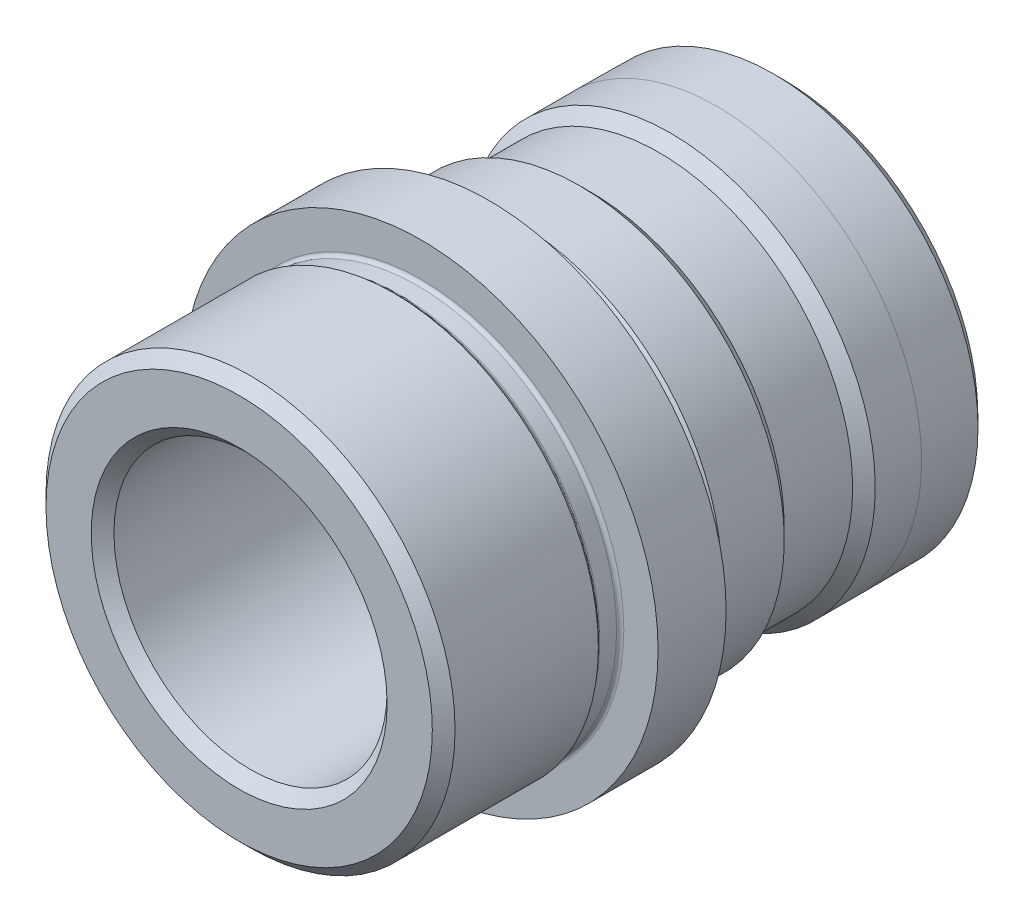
ISO-10303-21;
HEADER;
FILE_DESCRIPTION(('STEP AP214'),'2;1');
FILE_NAME('part.step','',(''),(''),'','','');
FILE_SCHEMA(('AUTOMOTIVE_DESIGN { 1 0 10303 214 1 1 1 1 }'));
ENDSEC;
DATA;
#1=APPLICATION_CONTEXT('core data for automotive mechanical design processes');
#2=APPLICATION_PROTOCOL_DEFINITION('international standard','automotive_design',2000,#1);
#3=PRODUCT_CONTEXT('',#1,'mechanical');
#4=PRODUCT('Part','Part','',(#3));
#5=PRODUCT_RELATED_PRODUCT_CATEGORY('part','',(#4));
#6=PRODUCT_DEFINITION_FORMATION('','',#4);
#7=PRODUCT_DEFINITION_CONTEXT('part definition',#1,'design');
#8=PRODUCT_DEFINITION('design','',#6,#7);
#9=PRODUCT_DEFINITION_SHAPE('','',#8);
#10=(LENGTH_UNIT() NAMED_UNIT(*) SI_UNIT(.MILLI.,.METRE.));
#11=(NAMED_UNIT(*) PLANE_ANGLE_UNIT() SI_UNIT($,.RADIAN.));
#12=(NAMED_UNIT(*) SI_UNIT($,.STERADIAN.) SOLID_ANGLE_UNIT());
#13=UNCERTAINTY_MEASURE_WITH_UNIT(LENGTH_MEASURE(1.E-05),#10,'distance_accuracy_value','');
#14=(GEOMETRIC_REPRESENTATION_CONTEXT(3) GLOBAL_UNCERTAINTY_ASSIGNED_CONTEXT((#13)) GLOBAL_UNIT_ASSIGNED_CONTEXT((#10,
#11,#12)) REPRESENTATION_CONTEXT('',''));
#15=CARTESIAN_POINT('',(0.,0.,0.));
#16=DIRECTION('',(0.,0.,1.));
#17=DIRECTION('',(1.,0.,0.));
#18=AXIS2_PLACEMENT_3D('',#15,#16,#17);
#19=CARTESIAN_POINT('',(0.,9.53262,12.7));
#20=DIRECTION('',(0.,0.,1.));
#21=DIRECTION('',(1.,0.,0.));
#22=AXIS2_PLACEMENT_3D('',#19,#20,#21);
#23=PLANE('',#22);
#24=CARTESIAN_POINT('',(0.,0.,12.7));
#25=DIRECTION('',(0.,0.,1.));
#26=DIRECTION('',(1.,0.,0.));
#27=AXIS2_PLACEMENT_3D('',#24,#25,#26);
#28=CIRCLE('',#27,13.48105);
#29=CARTESIAN_POINT('',(13.48105,0.,12.7));
#30=VERTEX_POINT('',#29);
#31=EDGE_CURVE('E65',#30,#30,#28,.T.);
#32=ORIENTED_EDGE('',*,*,#31,.T.);
#33=EDGE_LOOP('',(#32));
#34=FACE_BOUND('',#33,.T.);
#35=CARTESIAN_POINT('',(0.,0.,12.7));
#36=DIRECTION('',(0.,0.,1.));
#37=DIRECTION('',(1.,0.,0.));
#38=AXIS2_PLACEMENT_3D('',#35,#36,#37);
#39=CIRCLE('',#38,10.32637);
#40=CARTESIAN_POINT('',(10.32637,0.,12.7));
#41=VERTEX_POINT('',#40);
#42=EDGE_CURVE('E68',#41,#41,#39,.F.);
#43=ORIENTED_EDGE('',*,*,#42,.T.);
#44=EDGE_LOOP('',(#43));
#45=FACE_BOUND('',#44,.T.);
#46=ADVANCED_FACE('F30',(#34,#45),#23,.T.);
#47=CARTESIAN_POINT('',(0.,0.,0.));
#48=DIRECTION('',(0.,0.,-1.));
#49=DIRECTION('',(-1.,0.,0.));
#50=AXIS2_PLACEMENT_3D('',#47,#48,#49);
#51=CYLINDRICAL_SURFACE('',#50,14.2748);
#52=CARTESIAN_POINT('',(0.,0.,11.90625));
#53=DIRECTION('',(0.,0.,1.));
#54=DIRECTION('',(1.,0.,0.));
#55=AXIS2_PLACEMENT_3D('',#52,#53,#54);
#56=CIRCLE('',#55,14.2748);
#57=CARTESIAN_POINT('',(14.2748,0.,11.90625));
#58=VERTEX_POINT('',#57);
#59=EDGE_CURVE('E71',#58,#58,#56,.F.);
#60=ORIENTED_EDGE('',*,*,#59,.T.);
#61=EDGE_LOOP('',(#60));
#62=FACE_BOUND('',#61,.T.);
#63=CARTESIAN_POINT('',(0.,0.,1.905));
#64=DIRECTION('',(0.,0.,-1.));
#65=DIRECTION('',(-1.,0.,0.));
#66=AXIS2_PLACEMENT_3D('',#63,#64,#65);
#67=CIRCLE('',#66,14.2748);
#68=CARTESIAN_POINT('',(-14.2748,0.,1.905));
#69=VERTEX_POINT('',#68);
#70=EDGE_CURVE('E86',#69,#69,#67,.T.);
#71=ORIENTED_EDGE('',*,*,#70,.F.);
#72=EDGE_LOOP('',(#71));
#73=FACE_BOUND('',#72,.T.);
#74=ADVANCED_FACE('F155',(#62,#73),#51,.T.);
#75=CARTESIAN_POINT('',(0.,0.,1.524));
#76=DIRECTION('',(0.,0.,1.));
#77=DIRECTION('',(1.,0.,0.));
#78=AXIS2_PLACEMENT_3D('',#75,#76,#77);
#79=CONICAL_SURFACE('',#78,13.8938,0.785398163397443);
#80=CARTESIAN_POINT('',(0.,0.,1.59839487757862));
#81=DIRECTION('',(0.,0.,1.));
#82=DIRECTION('',(1.,0.,0.));
#83=AXIS2_PLACEMENT_3D('',#80,#81,#82);
#84=CIRCLE('',#83,13.9681948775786);
#85=CARTESIAN_POINT('',(13.9681948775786,0.,1.59839487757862));
#86=VERTEX_POINT('',#85);
#87=EDGE_CURVE('E37',#86,#86,#84,.T.);
#88=ORIENTED_EDGE('',*,*,#87,.T.);
#89=EDGE_LOOP('',(#88));
#90=FACE_BOUND('',#89,.T.);
#91=ORIENTED_EDGE('',*,*,#70,.T.);
#92=EDGE_LOOP('',(#91));
#93=FACE_BOUND('',#92,.T.);
#94=ADVANCED_FACE('F151',(#90,#93),#79,.T.);
#95=CARTESIAN_POINT('',(0.,0.,0.));
#96=DIRECTION('',(0.,0.,-1.));
#97=DIRECTION('',(-1.,0.,0.));
#98=AXIS2_PLACEMENT_3D('',#95,#96,#97);
#99=CYLINDRICAL_SURFACE('',#98,13.8938);
#100=CARTESIAN_POINT('',(0.,0.,1.41878975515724));
#101=DIRECTION('',(0.,0.,-1.));
#102=DIRECTION('',(-1.,0.,0.));
#103=AXIS2_PLACEMENT_3D('',#100,#101,#102);
#104=CIRCLE('',#103,13.8938);
#105=CARTESIAN_POINT('',(-13.8938,0.,1.41878975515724));
#106=VERTEX_POINT('',#105);
#107=EDGE_CURVE('E41',#106,#106,#104,.T.);
#108=ORIENTED_EDGE('',*,*,#107,.T.);
#109=EDGE_LOOP('',(#108));
#110=FACE_BOUND('',#109,.T.);
#111=CARTESIAN_POINT('',(0.,0.,0.254));
#112=DIRECTION('',(0.,0.,1.));
#113=DIRECTION('',(1.,0.,0.));
#114=AXIS2_PLACEMENT_3D('',#111,#112,#113);
#115=CIRCLE('',#114,13.8938);
#116=CARTESIAN_POINT('',(13.8938,0.,0.254));
#117=VERTEX_POINT('',#116);
#118=EDGE_CURVE('E45',#117,#117,#115,.T.);
#119=ORIENTED_EDGE('',*,*,#118,.T.);
#120=EDGE_LOOP('',(#119));
#121=FACE_BOUND('',#120,.T.);
#122=ADVANCED_FACE('F148',(#110,#121),#99,.T.);
#123=CARTESIAN_POINT('',(0.,16.5354,0.));
#124=DIRECTION('',(0.,0.,1.));
#125=DIRECTION('',(1.,0.,0.));
#126=AXIS2_PLACEMENT_3D('',#123,#124,#125);
#127=PLANE('',#126);
#128=CARTESIAN_POINT('',(0.,0.,0.));
#129=DIRECTION('',(0.,0.,1.));
#130=DIRECTION('',(1.,0.,0.));
#131=AXIS2_PLACEMENT_3D('',#128,#129,#130);
#132=CIRCLE('',#131,14.1478);
#133=CARTESIAN_POINT('',(14.1478,0.,0.));
#134=VERTEX_POINT('',#133);
#135=EDGE_CURVE('E10',#134,#134,#132,.F.);
#136=ORIENTED_EDGE('',*,*,#135,.T.);
#137=EDGE_LOOP('',(#136));
#138=FACE_BOUND('',#137,.T.);
#139=CARTESIAN_POINT('',(0.,0.,0.));
#140=DIRECTION('',(0.,0.,-1.));
#141=DIRECTION('',(-1.,0.,0.));
#142=AXIS2_PLACEMENT_3D('',#139,#140,#141);
#143=CIRCLE('',#142,16.5354);
#144=CARTESIAN_POINT('',(-16.5354,0.,0.));
#145=VERTEX_POINT('',#144);
#146=EDGE_CURVE('E385',#145,#145,#143,.T.);
#147=ORIENTED_EDGE('',*,*,#146,.F.);
#148=EDGE_LOOP('',(#147));
#149=FACE_BOUND('',#148,.T.);
#150=ADVANCED_FACE('F144',(#138,#149),#127,.T.);
#151=CARTESIAN_POINT('',(0.,0.,0.));
#152=DIRECTION('',(0.,0.,-1.));
#153=DIRECTION('',(-1.,0.,0.));
#154=AXIS2_PLACEMENT_3D('',#151,#152,#153);
#155=CYLINDRICAL_SURFACE('',#154,16.5354);
#156=ORIENTED_EDGE('',*,*,#146,.T.);
#157=EDGE_LOOP('',(#156));
#158=FACE_BOUND('',#157,.T.);
#159=CARTESIAN_POINT('',(0.,0.,-4.7498));
#160=DIRECTION('',(0.,0.,-1.));
#161=DIRECTION('',(-1.,0.,0.));
#162=AXIS2_PLACEMENT_3D('',#159,#160,#161);
#163=CIRCLE('',#162,16.5354);
#164=CARTESIAN_POINT('',(-16.5354,0.,-4.7498));
#165=VERTEX_POINT('',#164);
#166=EDGE_CURVE('E383',#165,#165,#163,.T.);
#167=ORIENTED_EDGE('',*,*,#166,.F.);
#168=EDGE_LOOP('',(#167));
#169=FACE_BOUND('',#168,.T.);
#170=ADVANCED_FACE('F140',(#158,#169),#155,.T.);
#171=CARTESIAN_POINT('',(0.,16.5354,-4.7498));
#172=DIRECTION('',(0.,0.,-1.));
#173=DIRECTION('',(-1.,0.,0.));
#174=AXIS2_PLACEMENT_3D('',#171,#172,#173);
#175=PLANE('',#174);
#176=CARTESIAN_POINT('',(0.,0.,-4.7498));
#177=DIRECTION('',(0.,0.,-1.));
#178=DIRECTION('',(-1.,0.,0.));
#179=AXIS2_PLACEMENT_3D('',#176,#177,#178);
#180=CIRCLE('',#179,14.1478);
#181=CARTESIAN_POINT('',(-14.1478,0.,-4.7498));
#182=VERTEX_POINT('',#181);
#183=EDGE_CURVE('E50',#182,#182,#180,.F.);
#184=ORIENTED_EDGE('',*,*,#183,.T.);
#185=EDGE_LOOP('',(#184));
#186=FACE_BOUND('',#185,.T.);
#187=ORIENTED_EDGE('',*,*,#166,.T.);
#188=EDGE_LOOP('',(#187));
#189=FACE_BOUND('',#188,.T.);
#190=ADVANCED_FACE('F136',(#186,#189),#175,.T.);
#191=CARTESIAN_POINT('',(0.,0.,0.));
#192=DIRECTION('',(0.,0.,-1.));
#193=DIRECTION('',(-1.,0.,0.));
#194=AXIS2_PLACEMENT_3D('',#191,#192,#193);
#195=CYLINDRICAL_SURFACE('',#194,13.8938);
#196=CARTESIAN_POINT('',(0.,0.,-6.16858975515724));
#197=DIRECTION('',(0.,0.,-1.));
#198=DIRECTION('',(-1.,0.,0.));
#199=AXIS2_PLACEMENT_3D('',#196,#197,#198);
#200=CIRCLE('',#199,13.8938);
#201=CARTESIAN_POINT('',(-13.8938,0.,-6.16858975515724));
#202=VERTEX_POINT('',#201);
#203=EDGE_CURVE('E53',#202,#202,#200,.F.);
#204=ORIENTED_EDGE('',*,*,#203,.T.);
#205=EDGE_LOOP('',(#204));
#206=FACE_BOUND('',#205,.T.);
#207=CARTESIAN_POINT('',(0.,0.,-5.0038));
#208=DIRECTION('',(0.,0.,-1.));
#209=DIRECTION('',(-1.,0.,0.));
#210=AXIS2_PLACEMENT_3D('',#207,#208,#209);
#211=CIRCLE('',#210,13.8938);
#212=CARTESIAN_POINT('',(-13.8938,0.,-5.0038));
#213=VERTEX_POINT('',#212);
#214=EDGE_CURVE('E56',#213,#213,#211,.T.);
#215=ORIENTED_EDGE('',*,*,#214,.T.);
#216=EDGE_LOOP('',(#215));
#217=FACE_BOUND('',#216,.T.);
#218=ADVANCED_FACE('F132',(#206,#217),#195,.T.);
#219=CARTESIAN_POINT('',(0.,0.,-6.67385));
#220=DIRECTION('',(0.,0.,-1.));
#221=DIRECTION('',(-1.,0.,0.));
#222=AXIS2_PLACEMENT_3D('',#219,#220,#221);
#223=CONICAL_SURFACE('',#222,14.29385,0.78539816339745);
#224=CARTESIAN_POINT('',(0.,0.,-6.34819487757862));
#225=DIRECTION('',(0.,0.,-1.));
#226=DIRECTION('',(-1.,0.,0.));
#227=AXIS2_PLACEMENT_3D('',#224,#225,#226);
#228=CIRCLE('',#227,13.9681948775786);
#229=CARTESIAN_POINT('',(-13.9681948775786,0.,-6.34819487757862));
#230=VERTEX_POINT('',#229);
#231=EDGE_CURVE('E59',#230,#230,#228,.T.);
#232=ORIENTED_EDGE('',*,*,#231,.T.);
#233=EDGE_LOOP('',(#232));
#234=FACE_BOUND('',#233,.T.);
#235=CARTESIAN_POINT('',(0.,0.,-6.67385));
#236=DIRECTION('',(0.,0.,-1.));
#237=DIRECTION('',(-1.,0.,0.));
#238=AXIS2_PLACEMENT_3D('',#235,#236,#237);
#239=CIRCLE('',#238,14.29385);
#240=CARTESIAN_POINT('',(-14.29385,0.,-6.67385));
#241=VERTEX_POINT('',#240);
#242=EDGE_CURVE('E380',#241,#241,#239,.T.);
#243=ORIENTED_EDGE('',*,*,#242,.F.);
#244=EDGE_LOOP('',(#243));
#245=FACE_BOUND('',#244,.T.);
#246=ADVANCED_FACE('F128',(#234,#245),#223,.T.);
#247=CARTESIAN_POINT('',(0.,0.,0.));
#248=DIRECTION('',(0.,0.,-1.));
#249=DIRECTION('',(-1.,0.,0.));
#250=AXIS2_PLACEMENT_3D('',#247,#248,#249);
#251=CYLINDRICAL_SURFACE('',#250,14.29385);
#252=ORIENTED_EDGE('',*,*,#242,.T.);
#253=EDGE_LOOP('',(#252));
#254=FACE_BOUND('',#253,.T.);
#255=CARTESIAN_POINT('',(0.,0.,-11.049));
#256=DIRECTION('',(0.,0.,-1.));
#257=DIRECTION('',(-1.,0.,0.));
#258=AXIS2_PLACEMENT_3D('',#255,#256,#257);
#259=CIRCLE('',#258,14.29385);
#260=CARTESIAN_POINT('',(-14.29385,0.,-11.049));
#261=VERTEX_POINT('',#260);
#262=EDGE_CURVE('E377',#261,#261,#259,.T.);
#263=ORIENTED_EDGE('',*,*,#262,.F.);
#264=EDGE_LOOP('',(#263));
#265=FACE_BOUND('',#264,.T.);
#266=ADVANCED_FACE('F124',(#254,#265),#251,.T.);
#267=CARTESIAN_POINT('',(0.,0.,-11.8364));
#268=DIRECTION('',(0.,0.,1.));
#269=DIRECTION('',(1.,0.,0.));
#270=AXIS2_PLACEMENT_3D('',#267,#268,#269);
#271=CONICAL_SURFACE('',#270,13.50645,0.785398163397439);
#272=ORIENTED_EDGE('',*,*,#262,.T.);
#273=EDGE_LOOP('',(#272));
#274=FACE_BOUND('',#273,.T.);
#275=CARTESIAN_POINT('',(0.,0.,-11.8364));
#276=DIRECTION('',(0.,0.,-1.));
#277=DIRECTION('',(-1.,0.,0.));
#278=AXIS2_PLACEMENT_3D('',#275,#276,#277);
#279=CIRCLE('',#278,13.50645);
#280=CARTESIAN_POINT('',(-13.50645,0.,-11.8364));
#281=VERTEX_POINT('',#280);
#282=EDGE_CURVE('E371',#281,#281,#279,.T.);
#283=ORIENTED_EDGE('',*,*,#282,.F.);
#284=EDGE_LOOP('',(#283));
#285=FACE_BOUND('',#284,.T.);
#286=ADVANCED_FACE('F119',(#274,#285),#271,.T.);
#287=CARTESIAN_POINT('',(0.,0.,0.));
#288=DIRECTION('',(0.,0.,-1.));
#289=DIRECTION('',(-1.,0.,0.));
#290=AXIS2_PLACEMENT_3D('',#287,#288,#289);
#291=CYLINDRICAL_SURFACE('',#290,13.50645);
#292=CARTESIAN_POINT('',(0.,-13.50645,-11.8491));
#293=CARTESIAN_POINT('',(-0.132305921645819,-13.5064476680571,-11.8491052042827));
#294=CARTESIAN_POINT('',(-0.264681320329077,-13.5044857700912,-11.8601935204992));
#295=CARTESIAN_POINT('',(-0.525711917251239,-13.4968483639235,-11.9042310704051));
#296=CARTESIAN_POINT('',(-0.654363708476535,-13.4911695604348,-11.9371997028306));
#297=CARTESIAN_POINT('',(-0.904133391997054,-13.4767345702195,-12.023965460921));
#298=CARTESIAN_POINT('',(-1.02525761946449,-13.4679810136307,-12.0777447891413));
#299=CARTESIAN_POINT('',(-1.25674998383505,-13.448356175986,-12.2045570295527));
#300=CARTESIAN_POINT('',(-1.36711919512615,-13.4374851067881,-12.2775880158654));
#301=CARTESIAN_POINT('',(-1.57515120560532,-13.414699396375,-12.4416526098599));
#302=CARTESIAN_POINT('',(-1.67268357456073,-13.4027758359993,-12.5328503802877));
#303=CARTESIAN_POINT('',(-1.8511459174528,-13.3792963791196,-12.7303064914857));
#304=CARTESIAN_POINT('',(-1.93207478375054,-13.367740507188,-12.836565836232));
#305=CARTESIAN_POINT('',(-2.07556405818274,-13.3462183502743,-13.0620358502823));
#306=CARTESIAN_POINT('',(-2.13799389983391,-13.3362635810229,-13.181330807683));
#307=CARTESIAN_POINT('',(-2.24187765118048,-13.3191953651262,-13.4289191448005));
#308=CARTESIAN_POINT('',(-2.2833331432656,-13.3120817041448,-13.5572118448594));
#309=CARTESIAN_POINT('',(-2.34367717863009,-13.3015903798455,-13.8177655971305));
#310=CARTESIAN_POINT('',(-2.36279190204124,-13.2981752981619,-13.9499727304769));
#311=CARTESIAN_POINT('',(-2.37861341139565,-13.2953547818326,-14.2157584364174));
#312=CARTESIAN_POINT('',(-2.37532196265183,-13.2959490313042,-14.3493369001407));
#313=CARTESIAN_POINT('',(-2.34660843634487,-13.3010459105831,-14.6124486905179));
#314=CARTESIAN_POINT('',(-2.32144175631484,-13.3055034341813,-14.7420108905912));
#315=CARTESIAN_POINT('',(-2.25009356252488,-13.3177539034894,-14.9950449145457));
#316=CARTESIAN_POINT('',(-2.20391125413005,-13.3255469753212,-15.1185165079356));
#317=CARTESIAN_POINT('',(-2.09158773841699,-13.3436385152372,-15.3566216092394));
#318=CARTESIAN_POINT('',(-2.02534172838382,-13.3539500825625,-15.4712046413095));
#319=CARTESIAN_POINT('',(-1.8748455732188,-13.3759078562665,-15.6877249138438));
#320=CARTESIAN_POINT('',(-1.79059381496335,-13.3875541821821,-15.7896610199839));
#321=CARTESIAN_POINT('',(-1.60509241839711,-13.4110667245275,-15.9794710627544));
#322=CARTESIAN_POINT('',(-1.50362393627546,-13.4229337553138,-16.0671311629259));
#323=CARTESIAN_POINT('',(-1.28730619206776,-13.4454021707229,-16.2242149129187));
#324=CARTESIAN_POINT('',(-1.17245682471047,-13.4560035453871,-16.2936384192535));
#325=CARTESIAN_POINT('',(-0.932427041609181,-13.4747638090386,-16.4123028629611));
#326=CARTESIAN_POINT('',(-0.807236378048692,-13.482920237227,-16.4615234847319));
#327=CARTESIAN_POINT('',(-0.550189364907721,-13.4958521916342,-16.5381789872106));
#328=CARTESIAN_POINT('',(-0.418333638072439,-13.5006280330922,-16.5656158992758));
#329=CARTESIAN_POINT('',(-0.153541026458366,-13.5062179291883,-16.5976319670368));
#330=CARTESIAN_POINT('',(-0.0206406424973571,-13.5070828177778,-16.6025044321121));
#331=CARTESIAN_POINT('',(0.244076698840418,-13.5048930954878,-16.5900373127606));
#332=CARTESIAN_POINT('',(0.37589370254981,-13.5018386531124,-16.5726986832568));
#333=CARTESIAN_POINT('',(0.633786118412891,-13.4921850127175,-16.5165454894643));
#334=CARTESIAN_POINT('',(0.759894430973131,-13.4856100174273,-16.4778775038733));
#335=CARTESIAN_POINT('',(1.00383842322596,-13.4696494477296,-16.3803205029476));
#336=CARTESIAN_POINT('',(1.12167359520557,-13.4602637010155,-16.3214302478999));
#337=CARTESIAN_POINT('',(1.34699098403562,-13.4395962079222,-16.1844382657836));
#338=CARTESIAN_POINT('',(1.45436119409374,-13.4282968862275,-16.1061550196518));
#339=CARTESIAN_POINT('',(1.65454589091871,-13.4051051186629,-15.9328471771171));
#340=CARTESIAN_POINT('',(1.74735919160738,-13.3932126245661,-15.8378212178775));
#341=CARTESIAN_POINT('',(1.91689437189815,-13.3700086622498,-15.6324044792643));
#342=CARTESIAN_POINT('',(1.99341720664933,-13.3587055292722,-15.5218483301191));
#343=CARTESIAN_POINT('',(2.12680517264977,-13.3381207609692,-15.2892783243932));
#344=CARTESIAN_POINT('',(2.18367097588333,-13.3288390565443,-15.1672648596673));
#345=CARTESIAN_POINT('',(2.27583952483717,-13.3134118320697,-14.9157784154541));
#346=CARTESIAN_POINT('',(2.31123799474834,-13.3072524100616,-14.7863414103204));
#347=CARTESIAN_POINT('',(2.3597658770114,-13.2987335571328,-14.5232401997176));
#348=CARTESIAN_POINT('',(2.37289746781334,-13.2963737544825,-14.3895764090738));
#349=CARTESIAN_POINT('',(2.37645286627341,-13.2957385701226,-14.123805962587));
#350=CARTESIAN_POINT('',(2.36719024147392,-13.2974067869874,-13.9917035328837));
#351=CARTESIAN_POINT('',(2.32690178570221,-13.3045154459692,-13.730968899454));
#352=CARTESIAN_POINT('',(2.29587604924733,-13.3099558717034,-13.6023366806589));
#353=CARTESIAN_POINT('',(2.21306747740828,-13.3239735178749,-13.3523353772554));
#354=CARTESIAN_POINT('',(2.16131461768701,-13.3325462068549,-13.2309560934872));
#355=CARTESIAN_POINT('',(2.03855390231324,-13.3518663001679,-12.9985524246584));
#356=CARTESIAN_POINT('',(1.96754491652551,-13.3626138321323,-12.8875286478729));
#357=CARTESIAN_POINT('',(1.80718081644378,-13.3852498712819,-12.6774089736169));
#358=CARTESIAN_POINT('',(1.71759604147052,-13.3971515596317,-12.5784897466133));
#359=CARTESIAN_POINT('',(1.52310562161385,-13.4206525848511,-12.3969819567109));
#360=CARTESIAN_POINT('',(1.41819645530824,-13.4322518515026,-12.3143971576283));
#361=CARTESIAN_POINT('',(1.19506142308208,-13.4539462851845,-12.1673093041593));
#362=CARTESIAN_POINT('',(1.07673831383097,-13.4640290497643,-12.1029519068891));
#363=CARTESIAN_POINT('',(0.830826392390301,-13.4814337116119,-11.9951289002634));
#364=CARTESIAN_POINT('',(0.703246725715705,-13.4887582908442,-11.9516429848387));
#365=CARTESIAN_POINT('',(0.479350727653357,-13.4982673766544,-11.8959782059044));
#366=CARTESIAN_POINT('',(0.384370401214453,-13.5013190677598,-11.8784278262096));
#367=CARTESIAN_POINT('',(0.192939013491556,-13.505411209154,-11.8549869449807));
#368=CARTESIAN_POINT('',(0.0964879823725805,-13.5064517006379,-11.8490962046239));
#369=CARTESIAN_POINT('',(0.,-13.50645,-11.8491));
#370=B_SPLINE_CURVE_WITH_KNOTS('',3,(#292,#293,#294,#295,#296,#297,#298,#299,#300,#301,#302,
#303,#304,#305,#306,#307,#308,#309,#310,#311,#312,#313,#314,#315,#316,#317,#318,#319,#320,#321,
#322,#323,#324,#325,#326,#327,#328,#329,#330,#331,#332,#333,#334,#335,#336,#337,#338,#339,#340,
#341,#342,#343,#344,#345,#346,#347,#348,#349,#350,#351,#352,#353,#354,#355,#356,#357,#358,#359,
#360,#361,#362,#363,#364,#365,#366,#367,#368,#369),.UNSPECIFIED.,.T.,.F.,(4,2,2,2,2,2,2,2,2,2,2,
2,2,2,2,2,2,2,2,2,2,2,2,2,2,2,2,2,2,2,2,2,2,2,2,2,2,2,4),(0.,0.396565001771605,
0.793482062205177,1.19006042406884,1.58659912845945,1.98689848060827,2.38722452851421,
2.79031223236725,3.19336952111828,3.59230986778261,3.9912187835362,4.38553198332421,
4.77986009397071,5.17628458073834,5.57274459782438,5.97468435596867,6.37662727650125,
6.77897339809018,7.18128199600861,7.57834613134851,7.97539319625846,8.36974508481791,
8.76412115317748,9.16233814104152,9.56058755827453,9.96345438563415,10.3663074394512,
10.7673506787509,11.1683546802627,11.5637763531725,11.959196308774,12.3540464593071,
12.748919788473,13.1490021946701,13.5491766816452,13.9524641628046,14.3553584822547,
14.6445710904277,14.9337777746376),.UNSPECIFIED.);
#371=CARTESIAN_POINT('',(0.,-13.50645,-11.8491));
#372=VERTEX_POINT('',#371);
#373=EDGE_CURVE('E94',#372,#372,#370,.T.);
#374=ORIENTED_EDGE('',*,*,#373,.F.);
#375=EDGE_LOOP('',(#374));
#376=FACE_BOUND('',#375,.T.);
#377=ORIENTED_EDGE('',*,*,#282,.T.);
#378=EDGE_LOOP('',(#377));
#379=FACE_BOUND('',#378,.T.);
#380=CARTESIAN_POINT('',(0.,0.,-16.6116));
#381=DIRECTION('',(0.,0.,-1.));
#382=DIRECTION('',(-1.,0.,0.));
#383=AXIS2_PLACEMENT_3D('',#380,#381,#382);
#384=CIRCLE('',#383,13.50645);
#385=CARTESIAN_POINT('',(-13.50645,0.,-16.6116));
#386=VERTEX_POINT('',#385);
#387=EDGE_CURVE('E367',#386,#386,#384,.T.);
#388=ORIENTED_EDGE('',*,*,#387,.F.);
#389=EDGE_LOOP('',(#388));
#390=FACE_BOUND('',#389,.T.);
#391=ADVANCED_FACE('F113',(#376,#379,#390),#291,.T.);
#392=CARTESIAN_POINT('',(0.,0.,-17.399));
#393=DIRECTION('',(0.,0.,-1.));
#394=DIRECTION('',(-1.,0.,0.));
#395=AXIS2_PLACEMENT_3D('',#392,#393,#394);
#396=CONICAL_SURFACE('',#395,14.29385,0.785398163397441);
#397=ORIENTED_EDGE('',*,*,#387,.T.);
#398=EDGE_LOOP('',(#397));
#399=FACE_BOUND('',#398,.T.);
#400=CARTESIAN_POINT('',(0.,0.,-17.399));
#401=DIRECTION('',(0.,0.,-1.));
#402=DIRECTION('',(-1.,0.,0.));
#403=AXIS2_PLACEMENT_3D('',#400,#401,#402);
#404=CIRCLE('',#403,14.29385);
#405=CARTESIAN_POINT('',(-14.29385,0.,-17.399));
#406=VERTEX_POINT('',#405);
#407=EDGE_CURVE('E370',#406,#406,#404,.T.);
#408=ORIENTED_EDGE('',*,*,#407,.F.);
#409=EDGE_LOOP('',(#408));
#410=FACE_BOUND('',#409,.T.);
#411=ADVANCED_FACE('F118',(#399,#410),#396,.T.);
#412=CARTESIAN_POINT('',(0.,0.,0.));
#413=DIRECTION('',(0.,0.,-1.));
#414=DIRECTION('',(-1.,0.,0.));
#415=AXIS2_PLACEMENT_3D('',#412,#413,#414);
#416=CYLINDRICAL_SURFACE('',#415,14.29385);
#417=ORIENTED_EDGE('',*,*,#407,.T.);
#418=EDGE_LOOP('',(#417));
#419=FACE_BOUND('',#418,.T.);
#420=CARTESIAN_POINT('',(0.,0.,-20.6375));
#421=DIRECTION('',(0.,0.,-1.));
#422=DIRECTION('',(-1.,0.,0.));
#423=AXIS2_PLACEMENT_3D('',#420,#421,#422);
#424=CIRCLE('',#423,14.29385);
#425=CARTESIAN_POINT('',(-14.29385,0.,-20.6375));
#426=VERTEX_POINT('',#425);
#427=EDGE_CURVE('E111',#426,#426,#424,.T.);
#428=ORIENTED_EDGE('',*,*,#427,.F.);
#429=EDGE_LOOP('',(#428));
#430=FACE_BOUND('',#429,.T.);
#431=ADVANCED_FACE('F300',(#419,#430),#416,.T.);
#432=CARTESIAN_POINT('',(0.,0.,-25.4));
#433=DIRECTION('',(0.,0.,1.));
#434=DIRECTION('',(1.,0.,0.));
#435=AXIS2_PLACEMENT_3D('',#432,#433,#434);
#436=CONICAL_SURFACE('',#435,14.2522882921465,0.00872664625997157);
#437=CARTESIAN_POINT('',(0.,0.,-24.6062802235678));
#438=DIRECTION('',(0.,0.,-1.));
#439=DIRECTION('',(-1.,0.,0.));
#440=AXIS2_PLACEMENT_3D('',#437,#438,#439);
#441=CIRCLE('',#440,14.2592149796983);
#442=CARTESIAN_POINT('',(-14.2592149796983,0.,-24.6062802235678));
#443=VERTEX_POINT('',#442);
#444=EDGE_CURVE('E74',#443,#443,#441,.F.);
#445=ORIENTED_EDGE('',*,*,#444,.T.);
#446=EDGE_LOOP('',(#445));
#447=FACE_BOUND('',#446,.T.);
#448=ORIENTED_EDGE('',*,*,#427,.T.);
#449=EDGE_LOOP('',(#448));
#450=FACE_BOUND('',#449,.T.);
#451=ADVANCED_FACE('F291',(#447,#450),#436,.T.);
#452=CARTESIAN_POINT('',(0.,14.2522882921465,-25.4));
#453=DIRECTION('',(0.,0.,-1.));
#454=DIRECTION('',(-1.,0.,0.));
#455=AXIS2_PLACEMENT_3D('',#452,#453,#454);
#456=PLANE('',#455);
#457=CARTESIAN_POINT('',(0.,0.,-25.4));
#458=DIRECTION('',(0.,0.,-1.));
#459=DIRECTION('',(-1.,0.,0.));
#460=AXIS2_PLACEMENT_3D('',#457,#458,#459);
#461=CIRCLE('',#460,13.4515198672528);
#462=CARTESIAN_POINT('',(-13.4515198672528,0.,-25.4));
#463=VERTEX_POINT('',#462);
#464=EDGE_CURVE('E77',#463,#463,#461,.T.);
#465=ORIENTED_EDGE('',*,*,#464,.T.);
#466=EDGE_LOOP('',(#465));
#467=FACE_BOUND('',#466,.T.);
#468=CARTESIAN_POINT('',(0.,0.,-25.4));
#469=DIRECTION('',(0.,0.,-1.));
#470=DIRECTION('',(-1.,0.,0.));
#471=AXIS2_PLACEMENT_3D('',#468,#469,#470);
#472=CIRCLE('',#471,12.58062);
#473=CARTESIAN_POINT('',(-12.58062,0.,-25.4));
#474=VERTEX_POINT('',#473);
#475=EDGE_CURVE('E80',#474,#474,#472,.F.);
#476=ORIENTED_EDGE('',*,*,#475,.T.);
#477=EDGE_LOOP('',(#476));
#478=FACE_BOUND('',#477,.T.);
#479=ADVANCED_FACE('F281',(#467,#478),#456,.T.);
#480=CARTESIAN_POINT('',(0.,0.,0.));
#481=DIRECTION('',(0.,0.,-1.));
#482=DIRECTION('',(-1.,0.,0.));
#483=AXIS2_PLACEMENT_3D('',#480,#481,#482);
#484=CYLINDRICAL_SURFACE('',#483,9.53262);
#485=CARTESIAN_POINT('',(0.,0.,11.90625));
#486=DIRECTION('',(0.,0.,1.));
#487=DIRECTION('',(1.,0.,0.));
#488=AXIS2_PLACEMENT_3D('',#485,#486,#487);
#489=CIRCLE('',#488,9.53262);
#490=CARTESIAN_POINT('',(9.53262,0.,11.90625));
#491=VERTEX_POINT('',#490);
#492=EDGE_CURVE('E62',#491,#491,#489,.T.);
#493=ORIENTED_EDGE('',*,*,#492,.T.);
#494=EDGE_LOOP('',(#493));
#495=FACE_BOUND('',#494,.T.);
#496=CARTESIAN_POINT('',(0.,0.,-22.352));
#497=DIRECTION('',(0.,0.,-1.));
#498=DIRECTION('',(-1.,0.,0.));
#499=AXIS2_PLACEMENT_3D('',#496,#497,#498);
#500=CIRCLE('',#499,9.53262);
#501=CARTESIAN_POINT('',(-9.53262,0.,-22.352));
#502=VERTEX_POINT('',#501);
#503=EDGE_CURVE('E83',#502,#502,#500,.T.);
#504=ORIENTED_EDGE('',*,*,#503,.T.);
#505=EDGE_LOOP('',(#504));
#506=FACE_BOUND('',#505,.T.);
#507=CARTESIAN_POINT('',(0.,-9.53262,-11.8491));
#508=CARTESIAN_POINT('',(0.131229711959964,-9.53261777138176,-11.8491037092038));
#509=CARTESIAN_POINT('',(0.26250094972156,-9.52988314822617,-11.860013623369));
#510=CARTESIAN_POINT('',(0.521282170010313,-9.51923914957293,-11.9033002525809));
#511=CARTESIAN_POINT('',(0.648789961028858,-9.51132681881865,-11.9356892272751));
#512=CARTESIAN_POINT('',(0.896269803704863,-9.49120371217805,-12.0208310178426));
#513=CARTESIAN_POINT('',(1.01625067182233,-9.47899808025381,-12.0735594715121));
#514=CARTESIAN_POINT('',(1.24566381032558,-9.45158878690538,-12.1977979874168));
#515=CARTESIAN_POINT('',(1.35509574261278,-9.43638502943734,-12.2693086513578));
#516=CARTESIAN_POINT('',(1.56254420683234,-9.40428262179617,-12.4306274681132));
#517=CARTESIAN_POINT('',(1.66031411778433,-9.38735796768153,-12.5207476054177));
#518=CARTESIAN_POINT('',(1.83951990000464,-9.35389434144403,-12.7160591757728));
#519=CARTESIAN_POINT('',(1.92095393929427,-9.33735541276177,-12.8212522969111));
#520=CARTESIAN_POINT('',(2.0663341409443,-9.30627384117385,-13.0456360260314));
#521=CARTESIAN_POINT('',(2.13000481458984,-9.29176421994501,-13.1650101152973));
#522=CARTESIAN_POINT('',(2.23627941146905,-9.26676315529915,-13.4131871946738));
#523=CARTESIAN_POINT('',(2.27888667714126,-9.25627107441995,-13.5419886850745));
#524=CARTESIAN_POINT('',(2.34098442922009,-9.24076023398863,-13.8026535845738));
#525=CARTESIAN_POINT('',(2.36091814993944,-9.23563669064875,-13.934405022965));
#526=CARTESIAN_POINT('',(2.378483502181,-9.23112935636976,-14.1994739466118));
#527=CARTESIAN_POINT('',(2.37611873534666,-9.23174463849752,-14.3327911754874));
#528=CARTESIAN_POINT('',(2.34950796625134,-9.23855122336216,-14.5938132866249));
#529=CARTESIAN_POINT('',(2.32578973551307,-9.24460802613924,-14.7215760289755));
#530=CARTESIAN_POINT('',(2.25798705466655,-9.26140090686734,-14.9712494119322));
#531=CARTESIAN_POINT('',(2.2139011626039,-9.27213731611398,-15.0931596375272));
#532=CARTESIAN_POINT('',(2.10616381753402,-9.29720340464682,-15.3290846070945));
#533=CARTESIAN_POINT('',(2.04232049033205,-9.31156805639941,-15.4430078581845));
#534=CARTESIAN_POINT('',(1.89701476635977,-9.34225230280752,-15.6587136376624));
#535=CARTESIAN_POINT('',(1.81554930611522,-9.35857223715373,-15.7604940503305));
#536=CARTESIAN_POINT('',(1.63457626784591,-9.39189483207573,-15.9520498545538));
#537=CARTESIAN_POINT('',(1.53462321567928,-9.40890374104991,-16.0414038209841));
#538=CARTESIAN_POINT('',(1.32094779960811,-9.44127107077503,-16.202161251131));
#539=CARTESIAN_POINT('',(1.20722502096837,-9.45662944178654,-16.2735641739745));
#540=CARTESIAN_POINT('',(0.968639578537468,-9.48404080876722,-16.3965458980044));
#541=CARTESIAN_POINT('',(0.843740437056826,-9.4960824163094,-16.4480566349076));
#542=CARTESIAN_POINT('',(0.586689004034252,-9.51542062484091,-16.5292337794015));
#543=CARTESIAN_POINT('',(0.454538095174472,-9.52271812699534,-16.5589043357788));
#544=CARTESIAN_POINT('',(0.190337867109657,-9.53161268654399,-16.5949161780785));
#545=CARTESIAN_POINT('',(0.0583713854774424,-9.53334995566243,-16.6018314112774));
#546=CARTESIAN_POINT('',(-0.204833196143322,-9.53132746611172,-16.5937099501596));
#547=CARTESIAN_POINT('',(-0.336071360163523,-9.52756819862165,-16.5786752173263));
#548=CARTESIAN_POINT('',(-0.592102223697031,-9.51506484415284,-16.5275537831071));
#549=CARTESIAN_POINT('',(-0.716961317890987,-9.50639485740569,-16.491779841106));
#550=CARTESIAN_POINT('',(-0.958899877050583,-9.48504704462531,-16.4005524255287));
#551=CARTESIAN_POINT('',(-1.07597855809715,-9.47236881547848,-16.3450969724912));
#552=CARTESIAN_POINT('',(-1.3013190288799,-9.44407474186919,-16.2149659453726));
#553=CARTESIAN_POINT('',(-1.40938875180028,-9.42841100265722,-16.1399684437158));
#554=CARTESIAN_POINT('',(-1.61161285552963,-9.39595951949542,-15.9732940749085));
#555=CARTESIAN_POINT('',(-1.70576484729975,-9.37917158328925,-15.8816143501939));
#556=CARTESIAN_POINT('',(-1.87984326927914,-9.34585968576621,-15.6815139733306));
#557=CARTESIAN_POINT('',(-1.95936722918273,-9.32935212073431,-15.5727398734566));
#558=CARTESIAN_POINT('',(-2.09903213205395,-9.29892667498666,-15.3430515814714));
#559=CARTESIAN_POINT('',(-2.1591739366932,-9.28500867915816,-15.2221379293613));
#560=CARTESIAN_POINT('',(-2.2579202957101,-9.26149111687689,-14.9722524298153));
#561=CARTESIAN_POINT('',(-2.29665246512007,-9.25186602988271,-14.8433335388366));
#562=CARTESIAN_POINT('',(-2.3518177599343,-9.23799878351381,-14.5805376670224));
#563=CARTESIAN_POINT('',(-2.36825572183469,-9.23375545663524,-14.4466617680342));
#564=CARTESIAN_POINT('',(-2.37811460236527,-9.23122072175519,-14.1818465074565));
#565=CARTESIAN_POINT('',(-2.37217862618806,-9.2327630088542,-14.050932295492));
#566=CARTESIAN_POINT('',(-2.33892898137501,-9.2412414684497,-13.7920345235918));
#567=CARTESIAN_POINT('',(-2.31161573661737,-9.24817753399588,-13.6640509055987));
#568=CARTESIAN_POINT('',(-2.23673698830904,-9.26656966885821,-13.4153410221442));
#569=CARTESIAN_POINT('',(-2.18929131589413,-9.2779989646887,-13.2945765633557));
#570=CARTESIAN_POINT('',(-2.07558949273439,-9.30409370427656,-13.0626360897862));
#571=CARTESIAN_POINT('',(-2.00933075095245,-9.318759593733,-12.9514613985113));
#572=CARTESIAN_POINT('',(-1.8578640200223,-9.35014995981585,-12.7387467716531));
#573=CARTESIAN_POINT('',(-1.77220943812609,-9.36691793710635,-12.6375312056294));
#574=CARTESIAN_POINT('',(-1.58525377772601,-9.40036255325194,-12.4507008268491));
#575=CARTESIAN_POINT('',(-1.48394899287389,-9.41703916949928,-12.3650897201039));
#576=CARTESIAN_POINT('',(-1.26637379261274,-9.44877923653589,-12.2104007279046));
#577=CARTESIAN_POINT('',(-1.14986737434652,-9.46380835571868,-12.1416472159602));
#578=CARTESIAN_POINT('',(-0.90658654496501,-9.49019844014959,-12.0248113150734));
#579=CARTESIAN_POINT('',(-0.779819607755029,-9.50156204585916,-11.9767140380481));
#580=CARTESIAN_POINT('',(-0.54438995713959,-9.51765042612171,-11.9097380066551));
#581=CARTESIAN_POINT('',(-0.43685362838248,-9.52322557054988,-11.8870477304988));
#582=CARTESIAN_POINT('',(-0.219554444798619,-9.53071115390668,-11.8567277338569));
#583=CARTESIAN_POINT('',(-0.109791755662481,-9.53262186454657,-11.8490968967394));
#584=CARTESIAN_POINT('',(0.,-9.53262,-11.8491));
#585=B_SPLINE_CURVE_WITH_KNOTS('',3,(#507,#508,#509,#510,#511,#512,#513,#514,#515,#516,#517,
#518,#519,#520,#521,#522,#523,#524,#525,#526,#527,#528,#529,#530,#531,#532,#533,#534,#535,#536,
#537,#538,#539,#540,#541,#542,#543,#544,#545,#546,#547,#548,#549,#550,#551,#552,#553,#554,#555,
#556,#557,#558,#559,#560,#561,#562,#563,#564,#565,#566,#567,#568,#569,#570,#571,#572,#573,#574,
#575,#576,#577,#578,#579,#580,#581,#582,#583,#584),.UNSPECIFIED.,.T.,.F.,(4,2,2,2,2,2,2,2,2,2,2,
2,2,2,2,2,2,2,2,2,2,2,2,2,2,2,2,2,2,2,2,2,2,2,2,2,2,2,4),(0.,0.393286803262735,
0.786798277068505,1.17983986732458,1.5728940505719,1.97316842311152,2.37348765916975,
2.77970809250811,3.18586404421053,3.58393591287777,3.9819434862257,4.37037608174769,
4.75883618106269,5.15119392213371,5.54361992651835,5.94715530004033,6.35070283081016,
6.75561918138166,7.1604585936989,7.5550053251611,7.94951680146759,8.33822810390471,
8.72697851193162,9.1225896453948,9.51826860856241,9.92358767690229,10.3288887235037,
10.7317471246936,11.1345181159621,11.5258015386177,11.9170772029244,12.3060559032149,
12.695088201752,13.0942028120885,13.4934120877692,13.8997875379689,14.305869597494,
14.6349326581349,14.963971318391),.UNSPECIFIED.);
#586=CARTESIAN_POINT('',(0.,-9.53262,-11.8491));
#587=VERTEX_POINT('',#586);
#588=EDGE_CURVE('E87',#587,#587,#585,.T.);
#589=ORIENTED_EDGE('',*,*,#588,.F.);
#590=EDGE_LOOP('',(#589));
#591=FACE_BOUND('',#590,.T.);
#592=ADVANCED_FACE('F96',(#495,#506,#591),#484,.F.);
#593=CARTESIAN_POINT('',(0.,-16.5354,-14.224));
#594=DIRECTION('',(0.,1.,0.));
#595=DIRECTION('',(0.,0.,1.));
#596=AXIS2_PLACEMENT_3D('',#593,#594,#595);
#597=CYLINDRICAL_SURFACE('',#596,2.3749);
#598=ORIENTED_EDGE('',*,*,#373,.T.);
#599=EDGE_LOOP('',(#598));
#600=FACE_BOUND('',#599,.T.);
#601=ORIENTED_EDGE('',*,*,#588,.T.);
#602=EDGE_LOOP('',(#601));
#603=FACE_BOUND('',#602,.T.);
#604=ADVANCED_FACE('F99',(#600,#603),#597,.F.);
#605=CARTESIAN_POINT('',(0.,0.,-22.352));
#606=DIRECTION('',(0.,0.,-1.));
#607=DIRECTION('',(-1.,0.,0.));
#608=AXIS2_PLACEMENT_3D('',#605,#606,#607);
#609=TOROIDAL_SURFACE('',#608,12.58062,3.048);
#610=ORIENTED_EDGE('',*,*,#475,.F.);
#611=EDGE_LOOP('',(#610));
#612=FACE_BOUND('',#611,.T.);
#613=ORIENTED_EDGE('',*,*,#503,.F.);
#614=EDGE_LOOP('',(#613));
#615=FACE_BOUND('',#614,.T.);
#616=ADVANCED_FACE('F102',(#612,#615),#609,.T.);
#617=CARTESIAN_POINT('',(0.,0.,-25.4));
#618=DIRECTION('',(0.,0.,1.));
#619=DIRECTION('',(1.,0.,0.));
#620=AXIS2_PLACEMENT_3D('',#617,#618,#619);
#621=CONICAL_SURFACE('',#620,13.4515198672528,0.794124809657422);
#622=ORIENTED_EDGE('',*,*,#444,.F.);
#623=EDGE_LOOP('',(#622));
#624=FACE_BOUND('',#623,.T.);
#625=ORIENTED_EDGE('',*,*,#464,.F.);
#626=EDGE_LOOP('',(#625));
#627=FACE_BOUND('',#626,.T.);
#628=ADVANCED_FACE('F164',(#624,#627),#621,.T.);
#629=CARTESIAN_POINT('',(0.,0.,11.90625));
#630=DIRECTION('',(0.,0.,-1.));
#631=DIRECTION('',(-1.,0.,0.));
#632=AXIS2_PLACEMENT_3D('',#629,#630,#631);
#633=CONICAL_SURFACE('',#632,14.2748,0.78539816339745);
#634=ORIENTED_EDGE('',*,*,#31,.F.);
#635=EDGE_LOOP('',(#634));
#636=FACE_BOUND('',#635,.T.);
#637=ORIENTED_EDGE('',*,*,#59,.F.);
#638=EDGE_LOOP('',(#637));
#639=FACE_BOUND('',#638,.T.);
#640=ADVANCED_FACE('F168',(#636,#639),#633,.T.);
#641=CARTESIAN_POINT('',(0.,0.,12.7));
#642=DIRECTION('',(0.,0.,1.));
#643=DIRECTION('',(1.,0.,0.));
#644=AXIS2_PLACEMENT_3D('',#641,#642,#643);
#645=CONICAL_SURFACE('',#644,10.32637,0.785398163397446);
#646=ORIENTED_EDGE('',*,*,#492,.F.);
#647=EDGE_LOOP('',(#646));
#648=FACE_BOUND('',#647,.T.);
#649=ORIENTED_EDGE('',*,*,#42,.F.);
#650=EDGE_LOOP('',(#649));
#651=FACE_BOUND('',#650,.T.);
#652=ADVANCED_FACE('F172',(#648,#651),#645,.F.);
#653=CARTESIAN_POINT('',(0.,0.,-6.16858975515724));
#654=DIRECTION('',(0.,0.,-1.));
#655=DIRECTION('',(-1.,0.,0.));
#656=AXIS2_PLACEMENT_3D('',#653,#654,#655);
#657=TOROIDAL_SURFACE('',#656,14.1478,0.254);
#658=ORIENTED_EDGE('',*,*,#203,.F.);
#659=EDGE_LOOP('',(#658));
#660=FACE_BOUND('',#659,.T.);
#661=ORIENTED_EDGE('',*,*,#231,.F.);
#662=EDGE_LOOP('',(#661));
#663=FACE_BOUND('',#662,.T.);
#664=ADVANCED_FACE('F176',(#660,#663),#657,.F.);
#665=CARTESIAN_POINT('',(0.,0.,-5.0038));
#666=DIRECTION('',(0.,0.,-1.));
#667=DIRECTION('',(-1.,0.,0.));
#668=AXIS2_PLACEMENT_3D('',#665,#666,#667);
#669=TOROIDAL_SURFACE('',#668,14.1478,0.254);
#670=ORIENTED_EDGE('',*,*,#183,.F.);
#671=EDGE_LOOP('',(#670));
#672=FACE_BOUND('',#671,.T.);
#673=ORIENTED_EDGE('',*,*,#214,.F.);
#674=EDGE_LOOP('',(#673));
#675=FACE_BOUND('',#674,.T.);
#676=ADVANCED_FACE('F180',(#672,#675),#669,.F.);
#677=CARTESIAN_POINT('',(0.,0.,1.41878975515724));
#678=DIRECTION('',(0.,0.,-1.));
#679=DIRECTION('',(-1.,0.,0.));
#680=AXIS2_PLACEMENT_3D('',#677,#678,#679);
#681=TOROIDAL_SURFACE('',#680,14.1478,0.254);
#682=ORIENTED_EDGE('',*,*,#87,.F.);
#683=EDGE_LOOP('',(#682));
#684=FACE_BOUND('',#683,.T.);
#685=ORIENTED_EDGE('',*,*,#107,.F.);
#686=EDGE_LOOP('',(#685));
#687=FACE_BOUND('',#686,.T.);
#688=ADVANCED_FACE('F183',(#684,#687),#681,.F.);
#689=CARTESIAN_POINT('',(0.,0.,0.254));
#690=DIRECTION('',(0.,0.,1.));
#691=DIRECTION('',(1.,0.,0.));
#692=AXIS2_PLACEMENT_3D('',#689,#690,#691);
#693=TOROIDAL_SURFACE('',#692,14.1478,0.254);
#694=ORIENTED_EDGE('',*,*,#118,.F.);
#695=EDGE_LOOP('',(#694));
#696=FACE_BOUND('',#695,.T.);
#697=ORIENTED_EDGE('',*,*,#135,.F.);
#698=EDGE_LOOP('',(#697));
#699=FACE_BOUND('',#698,.T.);
#700=ADVANCED_FACE('F32',(#696,#699),#693,.F.);
#701=CLOSED_SHELL('',(#46,#74,#94,#122,#150,#170,#190,#218,#246,#266,#286,#391,#411,#431,#451,
#479,#592,#604,#616,#628,#640,#652,#664,#676,#688,#700));
#702=MANIFOLD_SOLID_BREP('B2',#701);
#703=ADVANCED_BREP_SHAPE_REPRESENTATION('',(#18,#702),#14);
#704=SHAPE_DEFINITION_REPRESENTATION(#9,#703);
ENDSEC;
END-ISO-10303-21;
